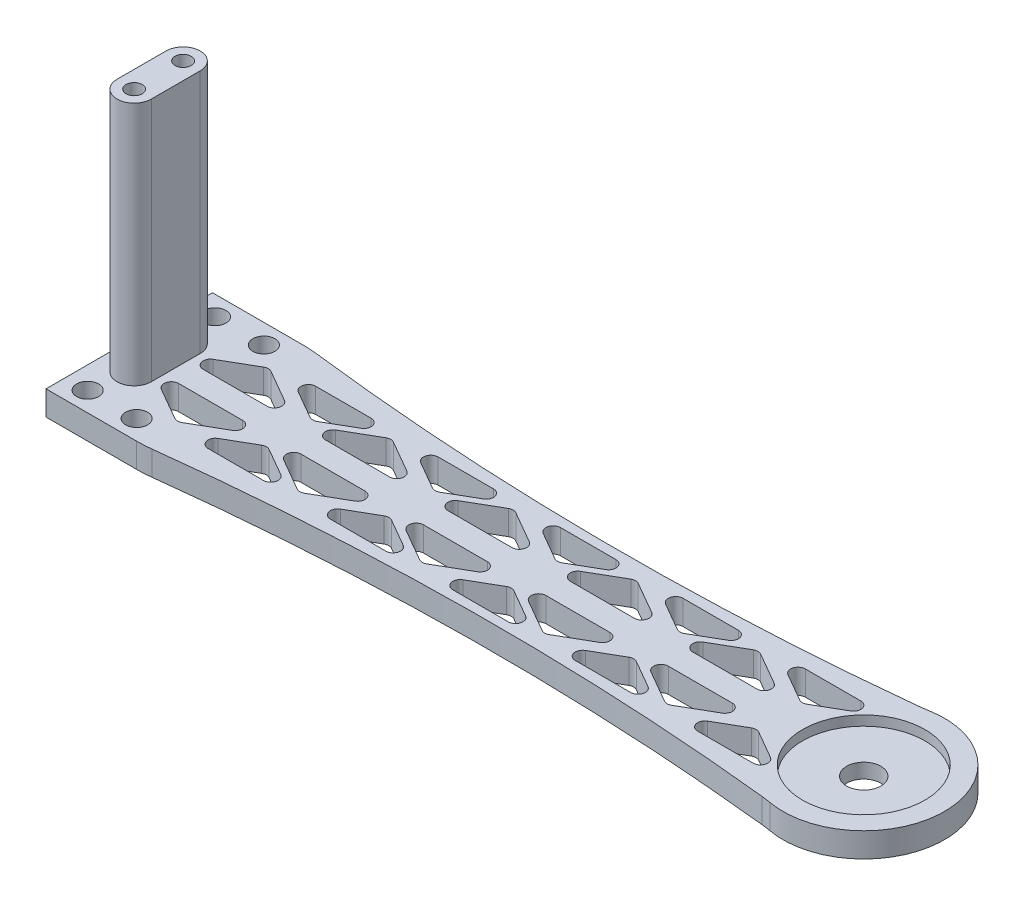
from build123d import *

# Parameters (mm, degrees)
EXTRUDE_1_DEPTH        = 2.5
SKETCH_2_R             = 12.5
CUT_EXTRUDE_1_DEPTH    = 2
SKETCH_3_R             = 3.5
CUT_EXTRUDE_2_DEPTH    = 168.392502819
CUT_EXTRUDE_3_DEPTH    = 168.440287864
CUT_EXTRUDE_4_DEPTH    = 168.440287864
SKETCH_6_R             = 2.25
CUT_EXTRUDE_5_DEPTH    = 168.440287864
FILLET_1_R             = 25
EXTRUDE_2_DEPTH        = 50
HOLE_WIZARD_M4_1_D     = 3.3
HOLE_WIZARD_M4_1_DEPTH = 11.5
HOLE_WIZARD_M4_1_TIP   = 0.991420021


with BuildPart() as part:
    # Sketch 1 → Extrude 1 (new, symmetric)
    with BuildSketch(Plane(origin=(0, 0, 0), x_dir=(1, 0, 0), z_dir=(0, 1, 0))):
        with BuildLine():
            Line((20, 17), (0, 17))
            Line((0, 17), (0, -17))
            Line((0, -17), (20, -17))
            ThreePointArc((20, -17), (83.152837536, -12.905656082), (146.357941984, -16.09302375))
            ThreePointArc((146.357941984, -16.09302375), (166.5, 0), (146.357941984, 16.09302375))
            ThreePointArc((146.357941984, 16.09302375), (83.152837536, 12.905656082), (20, 17))
        make_face()
    extrude(amount=EXTRUDE_1_DEPTH, both=True)

    # Sketch 2 → Cut-Extrude 1 (cut)
    with BuildSketch(Plane(origin=(0, 2.5, 0), x_dir=(1, 0, 0), z_dir=(0, 1, 0))):
        with Locations(Location((150, 0, 0), (0, 0, 270))):
            Circle(SKETCH_2_R)
    extrude(amount=-CUT_EXTRUDE_1_DEPTH, mode=Mode.SUBTRACT)

    # Sketch 3 → Cut-Extrude 2 (cut, through all)
    with BuildSketch(Plane(origin=(0, 0.5, 0), x_dir=(1, 0, 0), z_dir=(0, 1, 0))):
        with Locations(Location((150, 0, 0), (0, 0, 270))):
            Circle(SKETCH_3_R)
    extrude(amount=-CUT_EXTRUDE_2_DEPTH, mode=Mode.SUBTRACT)

    # Sketch 4 → Cut-Extrude 3 (cut, through all)
    with BuildSketch(Plane(origin=(0, 2.5, 0), x_dir=(1, 0, 0), z_dir=(0, 1, 0))):
        with BuildLine():
            Line((12.598076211, 2.5), (25.650635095, 2.5))
            ThreePointArc((25.650635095, 2.5), (27.099523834, 3.611771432), (26.400635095, 5.299038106))
            Line((26.400635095, 5.299038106), (19.874355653, 9.066987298))
            ThreePointArc((19.874355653, 9.066987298), (19.124355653, 9.267949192), (18.374355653, 9.066987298))
            Line((18.374355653, 9.066987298), (11.848076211, 5.299038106))
            ThreePointArc((11.848076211, 5.299038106), (11.149187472, 3.611771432), (12.598076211, 2.5))
        make_face()
        with BuildLine():
            Line((37.598076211, 2.5), (50.650635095, 2.5))
            ThreePointArc((50.650635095, 2.5), (52.099523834, 3.611771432), (51.400635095, 5.299038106))
            Line((51.400635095, 5.299038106), (44.874355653, 9.066987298))
            ThreePointArc((44.874355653, 9.066987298), (44.124355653, 9.267949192), (43.374355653, 9.066987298))
            Line((43.374355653, 9.066987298), (36.848076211, 5.299038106))
            ThreePointArc((36.848076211, 5.299038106), (36.149187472, 3.611771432), (37.598076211, 2.5))
        make_face()
        with BuildLine():
            Line((62.598076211, 2.5), (75.650635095, 2.5))
            ThreePointArc((75.650635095, 2.5), (77.099523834, 3.611771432), (76.400635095, 5.299038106))
            Line((76.400635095, 5.299038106), (69.874355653, 9.066987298))
            ThreePointArc((69.874355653, 9.066987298), (69.124355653, 9.267949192), (68.374355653, 9.066987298))
            Line((68.374355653, 9.066987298), (61.848076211, 5.299038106))
            ThreePointArc((61.848076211, 5.299038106), (61.149187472, 3.611771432), (62.598076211, 2.5))
        make_face()
        with BuildLine():
            Line((87.598076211, 2.5), (100.650635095, 2.5))
            ThreePointArc((100.650635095, 2.5), (102.099523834, 3.611771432), (101.400635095, 5.299038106))
            Line((101.400635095, 5.299038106), (94.874355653, 9.066987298))
            ThreePointArc((94.874355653, 9.066987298), (94.124355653, 9.267949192), (93.374355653, 9.066987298))
            Line((93.374355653, 9.066987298), (86.848076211, 5.299038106))
            ThreePointArc((86.848076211, 5.299038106), (86.149187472, 3.611771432), (87.598076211, 2.5))
        make_face()
        with BuildLine():
            Line((112.598076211, 2.5), (125.650635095, 2.5))
            ThreePointArc((125.650635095, 2.5), (127.099523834, 3.611771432), (126.400635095, 5.299038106))
            Line((126.400635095, 5.299038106), (119.874355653, 9.066987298))
            ThreePointArc((119.874355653, 9.066987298), (119.124355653, 9.267949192), (118.374355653, 9.066987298))
            Line((118.374355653, 9.066987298), (111.848076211, 5.299038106))
            ThreePointArc((111.848076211, 5.299038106), (111.149187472, 3.611771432), (112.598076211, 2.5))
        make_face()
        with BuildLine():
            Line((118.374355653, -9.066987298), (111.848076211, -5.299038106))
            ThreePointArc((111.848076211, -5.299038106), (111.149187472, -3.611771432), (112.598076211, -2.5))
            Line((112.598076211, -2.5), (125.650635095, -2.5))
            ThreePointArc((125.650635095, -2.5), (127.099523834, -3.611771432), (126.400635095, -5.299038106))
            Line((126.400635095, -5.299038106), (119.874355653, -9.066987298))
            ThreePointArc((119.874355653, -9.066987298), (119.124355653, -9.267949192), (118.374355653, -9.066987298))
        make_face()
        with BuildLine():
            Line((93.374355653, -9.066987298), (86.848076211, -5.299038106))
            ThreePointArc((86.848076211, -5.299038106), (86.149187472, -3.611771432), (87.598076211, -2.5))
            Line((87.598076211, -2.5), (100.650635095, -2.5))
            ThreePointArc((100.650635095, -2.5), (102.099523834, -3.611771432), (101.400635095, -5.299038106))
            Line((101.400635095, -5.299038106), (94.874355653, -9.066987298))
            ThreePointArc((94.874355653, -9.066987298), (94.124355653, -9.267949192), (93.374355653, -9.066987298))
        make_face()
        with BuildLine():
            Line((68.374355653, -9.066987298), (61.848076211, -5.299038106))
            ThreePointArc((61.848076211, -5.299038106), (61.149187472, -3.611771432), (62.598076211, -2.5))
            Line((62.598076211, -2.5), (75.650635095, -2.5))
            ThreePointArc((75.650635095, -2.5), (77.099523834, -3.611771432), (76.400635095, -5.299038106))
            Line((76.400635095, -5.299038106), (69.874355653, -9.066987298))
            ThreePointArc((69.874355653, -9.066987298), (69.124355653, -9.267949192), (68.374355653, -9.066987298))
        make_face()
        with BuildLine():
            Line((43.374355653, -9.066987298), (36.848076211, -5.299038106))
            ThreePointArc((36.848076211, -5.299038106), (36.149187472, -3.611771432), (37.598076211, -2.5))
            Line((37.598076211, -2.5), (50.650635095, -2.5))
            ThreePointArc((50.650635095, -2.5), (52.099523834, -3.611771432), (51.400635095, -5.299038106))
            Line((51.400635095, -5.299038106), (44.874355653, -9.066987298))
            ThreePointArc((44.874355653, -9.066987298), (44.124355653, -9.267949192), (43.374355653, -9.066987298))
        make_face()
        with BuildLine():
            Line((18.374355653, -9.066987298), (11.848076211, -5.299038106))
            ThreePointArc((11.848076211, -5.299038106), (11.149187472, -3.611771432), (12.598076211, -2.5))
            Line((12.598076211, -2.5), (25.650635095, -2.5))
            ThreePointArc((25.650635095, -2.5), (27.099523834, -3.611771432), (26.400635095, -5.299038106))
            Line((26.400635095, -5.299038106), (19.874355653, -9.066987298))
            ThreePointArc((19.874355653, -9.066987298), (19.124355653, -9.267949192), (18.374355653, -9.066987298))
        make_face()
    extrude(amount=-CUT_EXTRUDE_3_DEPTH, mode=Mode.SUBTRACT)

    # Sketch 5 → Cut-Extrude 4 (cut, through all)
    with BuildSketch(Plane(origin=(0, 2.5, 0), x_dir=(1, 0, 0), z_dir=(0, 1, 0))):
        with BuildLine():
            Line((127.081415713, 11), (138.401923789, 11))
            ThreePointArc((138.401923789, 11), (139.850812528, 9.888228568), (139.151923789, 8.200961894))
            Line((139.151923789, 8.200961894), (133.491669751, 4.933012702))
            ThreePointArc((133.491669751, 4.933012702), (132.741669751, 4.732050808), (131.991669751, 4.933012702))
            Line((131.991669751, 4.933012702), (126.331415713, 8.200961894))
            ThreePointArc((126.331415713, 8.200961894), (125.632526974, 9.888228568), (127.081415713, 11))
        make_face()
        with BuildLine():
            Line((102.081415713, 11), (113.401923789, 11))
            ThreePointArc((113.401923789, 11), (114.850812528, 9.888228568), (114.151923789, 8.200961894))
            Line((114.151923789, 8.200961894), (108.491669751, 4.933012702))
            ThreePointArc((108.491669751, 4.933012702), (107.741669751, 4.732050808), (106.991669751, 4.933012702))
            Line((106.991669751, 4.933012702), (101.331415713, 8.200961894))
            ThreePointArc((101.331415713, 8.200961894), (100.632526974, 9.888228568), (102.081415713, 11))
        make_face()
        with BuildLine():
            Line((77.081415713, 11), (88.401923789, 11))
            ThreePointArc((88.401923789, 11), (89.850812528, 9.888228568), (89.151923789, 8.200961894))
            Line((89.151923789, 8.200961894), (83.491669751, 4.933012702))
            ThreePointArc((83.491669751, 4.933012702), (82.741669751, 4.732050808), (81.991669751, 4.933012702))
            Line((81.991669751, 4.933012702), (76.331415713, 8.200961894))
            ThreePointArc((76.331415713, 8.200961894), (75.632526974, 9.888228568), (77.081415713, 11))
        make_face()
        with BuildLine():
            Line((52.081415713, 11), (63.401923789, 11))
            ThreePointArc((63.401923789, 11), (64.850812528, 9.888228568), (64.151923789, 8.200961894))
            Line((64.151923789, 8.200961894), (58.491669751, 4.933012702))
            ThreePointArc((58.491669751, 4.933012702), (57.741669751, 4.732050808), (56.991669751, 4.933012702))
            Line((56.991669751, 4.933012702), (51.331415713, 8.200961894))
            ThreePointArc((51.331415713, 8.200961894), (50.632526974, 9.888228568), (52.081415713, 11))
        make_face()
        with BuildLine():
            Line((27.081415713, 11), (38.401923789, 11))
            ThreePointArc((38.401923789, 11), (39.850812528, 9.888228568), (39.151923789, 8.200961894))
            Line((39.151923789, 8.200961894), (33.491669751, 4.933012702))
            ThreePointArc((33.491669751, 4.933012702), (32.741669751, 4.732050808), (31.991669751, 4.933012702))
            Line((31.991669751, 4.933012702), (26.331415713, 8.200961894))
            ThreePointArc((26.331415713, 8.200961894), (25.632526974, 9.888228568), (27.081415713, 11))
        make_face()
        with BuildLine():
            Line((31.991669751, -4.933012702), (26.331415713, -8.200961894))
            ThreePointArc((26.331415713, -8.200961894), (25.632526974, -9.888228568), (27.081415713, -11))
            Line((27.081415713, -11), (38.401923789, -11))
            ThreePointArc((38.401923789, -11), (39.850812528, -9.888228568), (39.151923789, -8.200961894))
            Line((39.151923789, -8.200961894), (33.491669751, -4.933012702))
            ThreePointArc((33.491669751, -4.933012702), (32.741669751, -4.732050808), (31.991669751, -4.933012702))
        make_face()
        with BuildLine():
            Line((56.991669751, -4.933012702), (51.331415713, -8.200961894))
            ThreePointArc((51.331415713, -8.200961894), (50.632526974, -9.888228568), (52.081415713, -11))
            Line((52.081415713, -11), (63.401923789, -11))
            ThreePointArc((63.401923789, -11), (64.850812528, -9.888228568), (64.151923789, -8.200961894))
            Line((64.151923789, -8.200961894), (58.491669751, -4.933012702))
            ThreePointArc((58.491669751, -4.933012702), (57.741669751, -4.732050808), (56.991669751, -4.933012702))
        make_face()
        with BuildLine():
            Line((81.991669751, -4.933012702), (76.331415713, -8.200961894))
            ThreePointArc((76.331415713, -8.200961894), (75.632526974, -9.888228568), (77.081415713, -11))
            Line((77.081415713, -11), (88.401923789, -11))
            ThreePointArc((88.401923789, -11), (89.850812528, -9.888228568), (89.151923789, -8.200961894))
            Line((89.151923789, -8.200961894), (83.491669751, -4.933012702))
            ThreePointArc((83.491669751, -4.933012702), (82.741669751, -4.732050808), (81.991669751, -4.933012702))
        make_face()
        with BuildLine():
            Line((106.991669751, -4.933012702), (101.331415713, -8.200961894))
            ThreePointArc((101.331415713, -8.200961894), (100.632526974, -9.888228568), (102.081415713, -11))
            Line((102.081415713, -11), (113.401923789, -11))
            ThreePointArc((113.401923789, -11), (114.850812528, -9.888228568), (114.151923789, -8.200961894))
            Line((114.151923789, -8.200961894), (108.491669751, -4.933012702))
            ThreePointArc((108.491669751, -4.933012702), (107.741669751, -4.732050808), (106.991669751, -4.933012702))
        make_face()
        with BuildLine():
            Line((131.991669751, -4.933012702), (126.331415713, -8.200961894))
            ThreePointArc((126.331415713, -8.200961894), (125.632526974, -9.888228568), (127.081415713, -11))
            Line((127.081415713, -11), (138.401923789, -11))
            ThreePointArc((138.401923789, -11), (139.850812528, -9.888228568), (139.151923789, -8.200961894))
            Line((139.151923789, -8.200961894), (133.491669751, -4.933012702))
            ThreePointArc((133.491669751, -4.933012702), (132.741669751, -4.732050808), (131.991669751, -4.933012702))
        make_face()
    extrude(amount=-CUT_EXTRUDE_4_DEPTH, mode=Mode.SUBTRACT)

    # Sketch 6 → Cut-Extrude 5 (cut, through all)
    with BuildSketch(Plane(origin=(0, 2.5, 0), x_dir=(1, 0, 0), z_dir=(0, 1, 0))):
        with Locations(Location((4.5, 13, 0), (0, 0, 270))):
            Circle(SKETCH_6_R)
        with Locations(Location((14.5, 13, 0), (0, 0, 270))):
            Circle(SKETCH_6_R)
    cut_extrude_5 = extrude(amount=-CUT_EXTRUDE_5_DEPTH, mode=Mode.SUBTRACT)

    # Mirror 1: Cut-Extrude 5 across plane
    add(cut_extrude_5.mirror(Plane.XY), mode=Mode.SUBTRACT)

    # Fillet 1
    fillet_1_edges = [part.edges().sort_by_distance(p)[0] for p in [
        (20, 0, -17),
        (146.357941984, 0, -16.09302375),
        (146.357941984, 0, 16.09302375),
        (20, 0, 17),
    ]]
    fillet(fillet_1_edges, radius=FILLET_1_R)

    # Sketch 8 → Extrude 2 (add)
    with BuildSketch(Plane(origin=(0, 2.5, 0), x_dir=(1, 0, 0), z_dir=(0, 1, 0))):
        with BuildLine():
            Line((9.5, 5), (9.5, -5))
            ThreePointArc((9.5, -5), (6, -8.5), (2.5, -5))
            Line((2.5, -5), (2.5, 5))
            ThreePointArc((2.5, 5), (6, 8.5), (9.5, 5))
        make_face()
    extrude(amount=EXTRUDE_2_DEPTH)

    # Hole Wizard M4 _1
    with Locations(Plane(origin=(6, 52.5, -5), x_dir=(0, 0, 1), z_dir=(0, 1, 0))):
        with Locations((0, 0), (10, 0)):
            Hole(HOLE_WIZARD_M4_1_D / 2, depth=HOLE_WIZARD_M4_1_DEPTH)
            with Locations((0, 0, -(HOLE_WIZARD_M4_1_DEPTH + HOLE_WIZARD_M4_1_TIP / 2))):  # 118° drill point
                Cone(0, HOLE_WIZARD_M4_1_D / 2, HOLE_WIZARD_M4_1_TIP, mode=Mode.SUBTRACT)


solid = part.part
